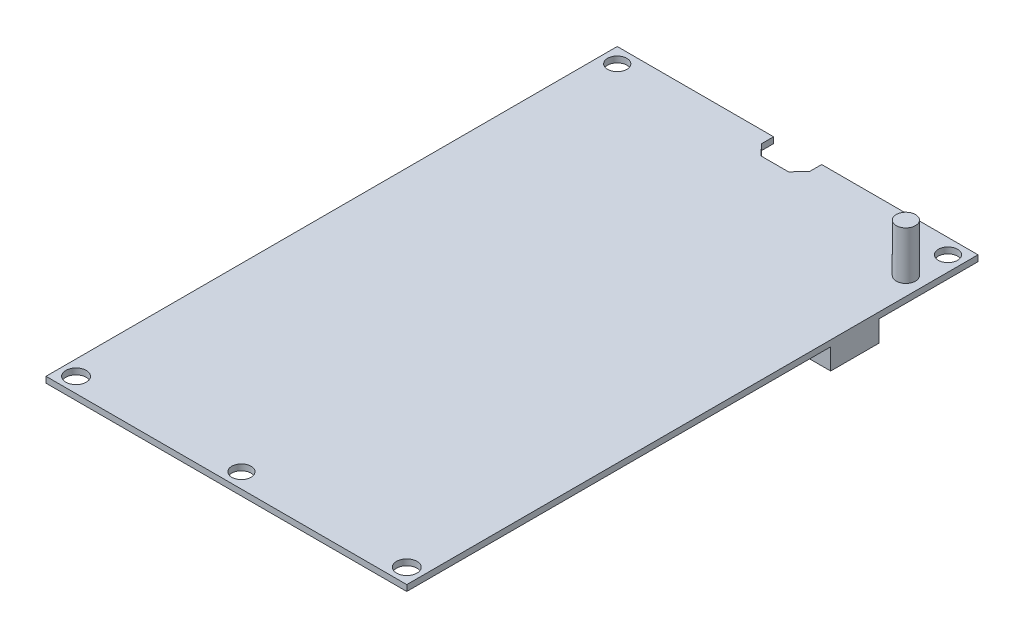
ISO-10303-21;
HEADER;
FILE_DESCRIPTION(('STEP AP214'),'2;1');
FILE_NAME('part.step','',(''),(''),'','','');
FILE_SCHEMA(('AUTOMOTIVE_DESIGN { 1 0 10303 214 1 1 1 1 }'));
ENDSEC;
DATA;
#1=APPLICATION_CONTEXT('core data for automotive mechanical design processes');
#2=APPLICATION_PROTOCOL_DEFINITION('international standard','automotive_design',2000,#1);
#3=PRODUCT_CONTEXT('',#1,'mechanical');
#4=PRODUCT('Part','Part','',(#3));
#5=PRODUCT_RELATED_PRODUCT_CATEGORY('part','',(#4));
#6=PRODUCT_DEFINITION_FORMATION('','',#4);
#7=PRODUCT_DEFINITION_CONTEXT('part definition',#1,'design');
#8=PRODUCT_DEFINITION('design','',#6,#7);
#9=PRODUCT_DEFINITION_SHAPE('','',#8);
#10=(LENGTH_UNIT() NAMED_UNIT(*) SI_UNIT(.MILLI.,.METRE.));
#11=(NAMED_UNIT(*) PLANE_ANGLE_UNIT() SI_UNIT($,.RADIAN.));
#12=(NAMED_UNIT(*) SI_UNIT($,.STERADIAN.) SOLID_ANGLE_UNIT());
#13=UNCERTAINTY_MEASURE_WITH_UNIT(LENGTH_MEASURE(1.E-05),#10,'distance_accuracy_value','');
#14=(GEOMETRIC_REPRESENTATION_CONTEXT(3) GLOBAL_UNCERTAINTY_ASSIGNED_CONTEXT((#13)) GLOBAL_UNIT_ASSIGNED_CONTEXT((#10,
#11,#12)) REPRESENTATION_CONTEXT('',''));
#15=CARTESIAN_POINT('',(0.,0.,0.));
#16=DIRECTION('',(0.,0.,1.));
#17=DIRECTION('',(1.,0.,0.));
#18=AXIS2_PLACEMENT_3D('',#15,#16,#17);
#19=CARTESIAN_POINT('',(0.,0.,0.));
#20=DIRECTION('',(0.,-1.,0.));
#21=DIRECTION('',(0.,0.,-1.));
#22=AXIS2_PLACEMENT_3D('',#19,#20,#21);
#23=PLANE('',#22);
#24=CARTESIAN_POINT('',(-27.5,0.,45.));
#25=DIRECTION('',(0.,1.,0.));
#26=DIRECTION('',(0.,0.,1.));
#27=AXIS2_PLACEMENT_3D('',#24,#25,#26);
#28=CIRCLE('',#27,1.7);
#29=CARTESIAN_POINT('',(-27.5,0.,46.7));
#30=VERTEX_POINT('',#29);
#31=EDGE_CURVE('E217',#30,#30,#28,.T.);
#32=ORIENTED_EDGE('',*,*,#31,.T.);
#33=EDGE_LOOP('',(#32));
#34=FACE_BOUND('',#33,.T.);
#35=CARTESIAN_POINT('',(27.5,0.,45.));
#36=DIRECTION('',(0.,1.,0.));
#37=DIRECTION('',(0.,0.,1.));
#38=AXIS2_PLACEMENT_3D('',#35,#36,#37);
#39=CIRCLE('',#38,1.7);
#40=CARTESIAN_POINT('',(27.5,0.,46.7));
#41=VERTEX_POINT('',#40);
#42=EDGE_CURVE('E224',#41,#41,#39,.T.);
#43=ORIENTED_EDGE('',*,*,#42,.T.);
#44=EDGE_LOOP('',(#43));
#45=FACE_BOUND('',#44,.T.);
#46=CARTESIAN_POINT('',(-27.5,0.,-45.));
#47=DIRECTION('',(0.,1.,0.));
#48=DIRECTION('',(0.,0.,1.));
#49=AXIS2_PLACEMENT_3D('',#46,#47,#48);
#50=CIRCLE('',#49,1.6);
#51=CARTESIAN_POINT('',(-27.5,0.,-43.4));
#52=VERTEX_POINT('',#51);
#53=EDGE_CURVE('E271',#52,#52,#50,.T.);
#54=ORIENTED_EDGE('',*,*,#53,.T.);
#55=EDGE_LOOP('',(#54));
#56=FACE_BOUND('',#55,.T.);
#57=CARTESIAN_POINT('',(27.5,0.,-45.));
#58=DIRECTION('',(0.,1.,0.));
#59=DIRECTION('',(0.,0.,1.));
#60=AXIS2_PLACEMENT_3D('',#57,#58,#59);
#61=CIRCLE('',#60,1.6);
#62=CARTESIAN_POINT('',(27.5,0.,-43.4));
#63=VERTEX_POINT('',#62);
#64=EDGE_CURVE('E278',#63,#63,#61,.T.);
#65=ORIENTED_EDGE('',*,*,#64,.T.);
#66=EDGE_LOOP('',(#65));
#67=FACE_BOUND('',#66,.T.);
#68=CARTESIAN_POINT('',(0.,0.,45.));
#69=DIRECTION('',(0.,1.,0.));
#70=DIRECTION('',(0.,0.,1.));
#71=AXIS2_PLACEMENT_3D('',#68,#69,#70);
#72=CIRCLE('',#71,1.6);
#73=CARTESIAN_POINT('',(0.,0.,46.6));
#74=VERTEX_POINT('',#73);
#75=EDGE_CURVE('E284',#74,#74,#72,.T.);
#76=ORIENTED_EDGE('',*,*,#75,.T.);
#77=EDGE_LOOP('',(#76));
#78=FACE_BOUND('',#77,.T.);
#79=DIRECTION('',(-1.,0.,0.));
#80=VECTOR('',#79,1.);
#81=CARTESIAN_POINT('',(15.,0.,-44.));
#82=LINE('',#81,#80);
#83=CARTESIAN_POINT('',(15.,0.,-44.));
#84=VERTEX_POINT('',#83);
#85=CARTESIAN_POINT('',(5.49999999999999,0.,-44.));
#86=VERTEX_POINT('',#85);
#87=EDGE_CURVE('E329',#84,#86,#82,.T.);
#88=ORIENTED_EDGE('',*,*,#87,.F.);
#89=DIRECTION('',(0.,0.,1.));
#90=VECTOR('',#89,1.);
#91=CARTESIAN_POINT('',(15.,0.,-47.5));
#92=LINE('',#91,#90);
#93=CARTESIAN_POINT('',(15.,0.,-47.5));
#94=VERTEX_POINT('',#93);
#95=EDGE_CURVE('E180',#94,#84,#92,.T.);
#96=ORIENTED_EDGE('',*,*,#95,.F.);
#97=DIRECTION('',(-1.,0.,0.));
#98=VECTOR('',#97,1.);
#99=CARTESIAN_POINT('',(-30.,0.,-47.5));
#100=LINE('',#99,#98);
#101=CARTESIAN_POINT('',(30.,0.,-47.5));
#102=VERTEX_POINT('',#101);
#103=EDGE_CURVE('E306',#102,#94,#100,.T.);
#104=ORIENTED_EDGE('',*,*,#103,.F.);
#105=DIRECTION('',(0.,0.,-1.));
#106=VECTOR('',#105,1.);
#107=CARTESIAN_POINT('',(30.,0.,47.5));
#108=LINE('',#107,#106);
#109=CARTESIAN_POINT('',(30.,0.,-31.));
#110=VERTEX_POINT('',#109);
#111=EDGE_CURVE('E274',#110,#102,#108,.T.);
#112=ORIENTED_EDGE('',*,*,#111,.F.);
#113=DIRECTION('',(1.,0.,0.));
#114=VECTOR('',#113,1.);
#115=CARTESIAN_POINT('',(30.,0.,-31.));
#116=LINE('',#115,#114);
#117=CARTESIAN_POINT('',(23.,0.,-31.));
#118=VERTEX_POINT('',#117);
#119=EDGE_CURVE('E56',#118,#110,#116,.T.);
#120=ORIENTED_EDGE('',*,*,#119,.F.);
#121=DIRECTION('',(0.,0.,-1.));
#122=VECTOR('',#121,1.);
#123=CARTESIAN_POINT('',(23.,0.,-23.));
#124=LINE('',#123,#122);
#125=CARTESIAN_POINT('',(23.,0.,-23.));
#126=VERTEX_POINT('',#125);
#127=EDGE_CURVE('E202',#126,#118,#124,.T.);
#128=ORIENTED_EDGE('',*,*,#127,.F.);
#129=DIRECTION('',(-1.,0.,0.));
#130=VECTOR('',#129,1.);
#131=CARTESIAN_POINT('',(30.,0.,-23.));
#132=LINE('',#131,#130);
#133=CARTESIAN_POINT('',(30.,0.,-23.));
#134=VERTEX_POINT('',#133);
#135=EDGE_CURVE('E185',#134,#126,#132,.T.);
#136=ORIENTED_EDGE('',*,*,#135,.F.);
#137=CARTESIAN_POINT('',(30.,0.,47.5));
#138=VERTEX_POINT('',#137);
#139=EDGE_CURVE('E302',#138,#134,#108,.T.);
#140=ORIENTED_EDGE('',*,*,#139,.F.);
#141=DIRECTION('',(1.,0.,0.));
#142=VECTOR('',#141,1.);
#143=CARTESIAN_POINT('',(-30.,0.,47.5));
#144=LINE('',#143,#142);
#145=CARTESIAN_POINT('',(-30.,0.,47.5));
#146=VERTEX_POINT('',#145);
#147=EDGE_CURVE('E293',#146,#138,#144,.T.);
#148=ORIENTED_EDGE('',*,*,#147,.F.);
#149=DIRECTION('',(0.,0.,1.));
#150=VECTOR('',#149,1.);
#151=CARTESIAN_POINT('',(-30.,0.,47.5));
#152=LINE('',#151,#150);
#153=CARTESIAN_POINT('',(-30.,0.,-47.5));
#154=VERTEX_POINT('',#153);
#155=EDGE_CURVE('E309',#154,#146,#152,.T.);
#156=ORIENTED_EDGE('',*,*,#155,.F.);
#157=CARTESIAN_POINT('',(-4.00000000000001,0.,-47.5));
#158=VERTEX_POINT('',#157);
#159=EDGE_CURVE('E305',#158,#154,#100,.T.);
#160=ORIENTED_EDGE('',*,*,#159,.F.);
#161=DIRECTION('',(0.,0.,1.));
#162=VECTOR('',#161,1.);
#163=CARTESIAN_POINT('',(-4.00000000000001,0.,-47.5));
#164=LINE('',#163,#162);
#165=CARTESIAN_POINT('',(-4.00000000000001,0.,-45.5));
#166=VERTEX_POINT('',#165);
#167=EDGE_CURVE('E229',#158,#166,#164,.T.);
#168=ORIENTED_EDGE('',*,*,#167,.T.);
#169=DIRECTION('',(0.684610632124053,0.,0.728908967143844));
#170=VECTOR('',#169,1.);
#171=CARTESIAN_POINT('',(-4.00000000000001,0.,-45.5));
#172=LINE('',#171,#170);
#173=CARTESIAN_POINT('',(-2.30000000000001,0.,-43.69));
#174=VERTEX_POINT('',#173);
#175=EDGE_CURVE('E232',#166,#174,#172,.T.);
#176=ORIENTED_EDGE('',*,*,#175,.T.);
#177=DIRECTION('',(1.,0.,0.));
#178=VECTOR('',#177,1.);
#179=CARTESIAN_POINT('',(-2.30000000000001,0.,-43.69));
#180=LINE('',#179,#178);
#181=CARTESIAN_POINT('',(2.29999999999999,0.,-43.69));
#182=VERTEX_POINT('',#181);
#183=EDGE_CURVE('E236',#174,#182,#180,.T.);
#184=ORIENTED_EDGE('',*,*,#183,.T.);
#185=DIRECTION('',(0.684610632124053,0.,-0.728908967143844));
#186=VECTOR('',#185,1.);
#187=CARTESIAN_POINT('',(2.29999999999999,0.,-43.69));
#188=LINE('',#187,#186);
#189=CARTESIAN_POINT('',(3.99999999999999,0.,-45.5));
#190=VERTEX_POINT('',#189);
#191=EDGE_CURVE('E239',#182,#190,#188,.T.);
#192=ORIENTED_EDGE('',*,*,#191,.T.);
#193=DIRECTION('',(0.,0.,-1.));
#194=VECTOR('',#193,1.);
#195=CARTESIAN_POINT('',(3.99999999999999,0.,-45.5));
#196=LINE('',#195,#194);
#197=CARTESIAN_POINT('',(3.99999999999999,0.,-47.5));
#198=VERTEX_POINT('',#197);
#199=EDGE_CURVE('E242',#190,#198,#196,.T.);
#200=ORIENTED_EDGE('',*,*,#199,.T.);
#201=CARTESIAN_POINT('',(5.49999999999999,0.,-47.5));
#202=VERTEX_POINT('',#201);
#203=EDGE_CURVE('E310',#202,#198,#100,.T.);
#204=ORIENTED_EDGE('',*,*,#203,.F.);
#205=DIRECTION('',(0.,0.,-1.));
#206=VECTOR('',#205,1.);
#207=CARTESIAN_POINT('',(5.49999999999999,0.,-47.5));
#208=LINE('',#207,#206);
#209=EDGE_CURVE('E176',#86,#202,#208,.T.);
#210=ORIENTED_EDGE('',*,*,#209,.F.);
#211=EDGE_LOOP('',(#88,#96,#104,#112,#120,#128,#136,#140,#148,#156,#160,#168,#176,#184,#192,
#200,#204,#210));
#212=FACE_BOUND('',#211,.T.);
#213=ADVANCED_FACE('F33',(#34,#45,#56,#67,#78,#212),#23,.T.);
#214=CARTESIAN_POINT('',(-30.,1.,-47.5));
#215=DIRECTION('',(0.,0.,1.));
#216=DIRECTION('',(1.,0.,0.));
#217=AXIS2_PLACEMENT_3D('',#214,#215,#216);
#218=PLANE('',#217);
#219=ORIENTED_EDGE('',*,*,#103,.T.);
#220=DIRECTION('',(0.,1.,0.));
#221=VECTOR('',#220,1.);
#222=CARTESIAN_POINT('',(15.,-2.5,-47.5));
#223=LINE('',#222,#221);
#224=CARTESIAN_POINT('',(15.,-2.5,-47.5));
#225=VERTEX_POINT('',#224);
#226=EDGE_CURVE('E336',#225,#94,#223,.T.);
#227=ORIENTED_EDGE('',*,*,#226,.F.);
#228=DIRECTION('',(1.,0.,0.));
#229=VECTOR('',#228,1.);
#230=CARTESIAN_POINT('',(15.,-2.5,-47.5));
#231=LINE('',#230,#229);
#232=CARTESIAN_POINT('',(5.49999999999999,-2.5,-47.5));
#233=VERTEX_POINT('',#232);
#234=EDGE_CURVE('E173',#233,#225,#231,.T.);
#235=ORIENTED_EDGE('',*,*,#234,.F.);
#236=DIRECTION('',(0.,1.,0.));
#237=VECTOR('',#236,1.);
#238=CARTESIAN_POINT('',(5.49999999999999,-2.5,-47.5));
#239=LINE('',#238,#237);
#240=EDGE_CURVE('E48',#233,#202,#239,.T.);
#241=ORIENTED_EDGE('',*,*,#240,.T.);
#242=ORIENTED_EDGE('',*,*,#203,.T.);
#243=DIRECTION('',(0.,1.,0.));
#244=VECTOR('',#243,1.);
#245=CARTESIAN_POINT('',(3.99999999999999,0.,-47.5));
#246=LINE('',#245,#244);
#247=CARTESIAN_POINT('',(3.99999999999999,1.,-47.5));
#248=VERTEX_POINT('',#247);
#249=EDGE_CURVE('E258',#198,#248,#246,.T.);
#250=ORIENTED_EDGE('',*,*,#249,.T.);
#251=DIRECTION('',(-1.,0.,0.));
#252=VECTOR('',#251,1.);
#253=CARTESIAN_POINT('',(-30.,1.,-47.5));
#254=LINE('',#253,#252);
#255=CARTESIAN_POINT('',(30.,1.,-47.5));
#256=VERTEX_POINT('',#255);
#257=EDGE_CURVE('E294',#256,#248,#254,.T.);
#258=ORIENTED_EDGE('',*,*,#257,.F.);
#259=DIRECTION('',(0.,-1.,0.));
#260=VECTOR('',#259,1.);
#261=CARTESIAN_POINT('',(30.,1.,-47.5));
#262=LINE('',#261,#260);
#263=EDGE_CURVE('E41',#256,#102,#262,.T.);
#264=ORIENTED_EDGE('',*,*,#263,.T.);
#265=EDGE_LOOP('',(#219,#227,#235,#241,#242,#250,#258,#264));
#266=FACE_BOUND('',#265,.T.);
#267=ADVANCED_FACE('F322',(#266),#218,.F.);
#268=CARTESIAN_POINT('',(30.,1.,47.5));
#269=DIRECTION('',(-1.,0.,0.));
#270=DIRECTION('',(0.,0.,1.));
#271=AXIS2_PLACEMENT_3D('',#268,#269,#270);
#272=PLANE('',#271);
#273=ORIENTED_EDGE('',*,*,#139,.T.);
#274=DIRECTION('',(0.,1.,0.));
#275=VECTOR('',#274,1.);
#276=CARTESIAN_POINT('',(30.,-3.5,-23.));
#277=LINE('',#276,#275);
#278=CARTESIAN_POINT('',(30.,-3.5,-23.));
#279=VERTEX_POINT('',#278);
#280=EDGE_CURVE('E213',#279,#134,#277,.T.);
#281=ORIENTED_EDGE('',*,*,#280,.F.);
#282=DIRECTION('',(0.,0.,1.));
#283=VECTOR('',#282,1.);
#284=CARTESIAN_POINT('',(30.,-3.5,-23.));
#285=LINE('',#284,#283);
#286=CARTESIAN_POINT('',(30.,-3.5,-31.));
#287=VERTEX_POINT('',#286);
#288=EDGE_CURVE('E190',#287,#279,#285,.T.);
#289=ORIENTED_EDGE('',*,*,#288,.F.);
#290=DIRECTION('',(0.,1.,0.));
#291=VECTOR('',#290,1.);
#292=CARTESIAN_POINT('',(30.,-3.5,-31.));
#293=LINE('',#292,#291);
#294=EDGE_CURVE('E199',#287,#110,#293,.T.);
#295=ORIENTED_EDGE('',*,*,#294,.T.);
#296=ORIENTED_EDGE('',*,*,#111,.T.);
#297=ORIENTED_EDGE('',*,*,#263,.F.);
#298=DIRECTION('',(0.,0.,-1.));
#299=VECTOR('',#298,1.);
#300=CARTESIAN_POINT('',(30.,1.,47.5));
#301=LINE('',#300,#299);
#302=CARTESIAN_POINT('',(30.,1.,47.5));
#303=VERTEX_POINT('',#302);
#304=EDGE_CURVE('E289',#303,#256,#301,.T.);
#305=ORIENTED_EDGE('',*,*,#304,.F.);
#306=DIRECTION('',(0.,-1.,0.));
#307=VECTOR('',#306,1.);
#308=CARTESIAN_POINT('',(30.,1.,47.5));
#309=LINE('',#308,#307);
#310=EDGE_CURVE('E301',#303,#138,#309,.T.);
#311=ORIENTED_EDGE('',*,*,#310,.T.);
#312=EDGE_LOOP('',(#273,#281,#289,#295,#296,#297,#305,#311));
#313=FACE_BOUND('',#312,.T.);
#314=ADVANCED_FACE('F35',(#313),#272,.F.);
#315=CARTESIAN_POINT('',(-4.00000000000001,1.,-47.5));
#316=VERTEX_POINT('',#315);
#317=CARTESIAN_POINT('',(-30.,1.,-47.5));
#318=VERTEX_POINT('',#317);
#319=EDGE_CURVE('E292',#316,#318,#254,.T.);
#320=ORIENTED_EDGE('',*,*,#319,.F.);
#321=DIRECTION('',(0.,1.,0.));
#322=VECTOR('',#321,1.);
#323=CARTESIAN_POINT('',(-4.00000000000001,0.,-47.5));
#324=LINE('',#323,#322);
#325=EDGE_CURVE('E245',#158,#316,#324,.T.);
#326=ORIENTED_EDGE('',*,*,#325,.F.);
#327=ORIENTED_EDGE('',*,*,#159,.T.);
#328=DIRECTION('',(0.,-1.,0.));
#329=VECTOR('',#328,1.);
#330=CARTESIAN_POINT('',(-30.,1.,-47.5));
#331=LINE('',#330,#329);
#332=EDGE_CURVE('E318',#318,#154,#331,.T.);
#333=ORIENTED_EDGE('',*,*,#332,.F.);
#334=EDGE_LOOP('',(#320,#326,#327,#333));
#335=FACE_BOUND('',#334,.T.);
#336=ADVANCED_FACE('F347',(#335),#218,.F.);
#337=CARTESIAN_POINT('',(-30.,1.,47.5));
#338=DIRECTION('',(1.,0.,0.));
#339=DIRECTION('',(0.,0.,-1.));
#340=AXIS2_PLACEMENT_3D('',#337,#338,#339);
#341=PLANE('',#340);
#342=ORIENTED_EDGE('',*,*,#155,.T.);
#343=DIRECTION('',(0.,-1.,0.));
#344=VECTOR('',#343,1.);
#345=CARTESIAN_POINT('',(-30.,1.,47.5));
#346=LINE('',#345,#344);
#347=CARTESIAN_POINT('',(-30.,1.,47.5));
#348=VERTEX_POINT('',#347);
#349=EDGE_CURVE('E315',#348,#146,#346,.T.);
#350=ORIENTED_EDGE('',*,*,#349,.F.);
#351=DIRECTION('',(0.,0.,1.));
#352=VECTOR('',#351,1.);
#353=CARTESIAN_POINT('',(-30.,1.,47.5));
#354=LINE('',#353,#352);
#355=EDGE_CURVE('E297',#318,#348,#354,.T.);
#356=ORIENTED_EDGE('',*,*,#355,.F.);
#357=ORIENTED_EDGE('',*,*,#332,.T.);
#358=EDGE_LOOP('',(#342,#350,#356,#357));
#359=FACE_BOUND('',#358,.T.);
#360=ADVANCED_FACE('F351',(#359),#341,.F.);
#361=CARTESIAN_POINT('',(-30.,1.,47.5));
#362=DIRECTION('',(0.,0.,-1.));
#363=DIRECTION('',(-1.,0.,0.));
#364=AXIS2_PLACEMENT_3D('',#361,#362,#363);
#365=PLANE('',#364);
#366=ORIENTED_EDGE('',*,*,#147,.T.);
#367=ORIENTED_EDGE('',*,*,#310,.F.);
#368=DIRECTION('',(1.,0.,0.));
#369=VECTOR('',#368,1.);
#370=CARTESIAN_POINT('',(-30.,1.,47.5));
#371=LINE('',#370,#369);
#372=EDGE_CURVE('E299',#348,#303,#371,.T.);
#373=ORIENTED_EDGE('',*,*,#372,.F.);
#374=ORIENTED_EDGE('',*,*,#349,.T.);
#375=EDGE_LOOP('',(#366,#367,#373,#374));
#376=FACE_BOUND('',#375,.T.);
#377=ADVANCED_FACE('F357',(#376),#365,.F.);
#378=CARTESIAN_POINT('',(0.,1.,0.));
#379=DIRECTION('',(0.,-1.,0.));
#380=DIRECTION('',(0.,0.,-1.));
#381=AXIS2_PLACEMENT_3D('',#378,#379,#380);
#382=PLANE('',#381);
#383=CARTESIAN_POINT('',(27.,1.,-38.5));
#384=DIRECTION('',(0.,-1.,0.));
#385=DIRECTION('',(0.,0.,-1.));
#386=AXIS2_PLACEMENT_3D('',#383,#384,#385);
#387=CIRCLE('',#386,1.6);
#388=CARTESIAN_POINT('',(27.,1.,-40.1));
#389=VERTEX_POINT('',#388);
#390=EDGE_CURVE('E11',#389,#389,#387,.F.);
#391=ORIENTED_EDGE('',*,*,#390,.F.);
#392=EDGE_LOOP('',(#391));
#393=FACE_BOUND('',#392,.T.);
#394=CARTESIAN_POINT('',(-27.5,1.,45.));
#395=DIRECTION('',(0.,1.,0.));
#396=DIRECTION('',(0.,0.,1.));
#397=AXIS2_PLACEMENT_3D('',#394,#395,#396);
#398=CIRCLE('',#397,1.7);
#399=CARTESIAN_POINT('',(-27.5,1.,46.7));
#400=VERTEX_POINT('',#399);
#401=EDGE_CURVE('E221',#400,#400,#398,.T.);
#402=ORIENTED_EDGE('',*,*,#401,.F.);
#403=EDGE_LOOP('',(#402));
#404=FACE_BOUND('',#403,.T.);
#405=CARTESIAN_POINT('',(27.5,1.,45.));
#406=DIRECTION('',(0.,1.,0.));
#407=DIRECTION('',(0.,0.,1.));
#408=AXIS2_PLACEMENT_3D('',#405,#406,#407);
#409=CIRCLE('',#408,1.7);
#410=CARTESIAN_POINT('',(27.5,1.,46.7));
#411=VERTEX_POINT('',#410);
#412=EDGE_CURVE('E216',#411,#411,#409,.T.);
#413=ORIENTED_EDGE('',*,*,#412,.F.);
#414=EDGE_LOOP('',(#413));
#415=FACE_BOUND('',#414,.T.);
#416=CARTESIAN_POINT('',(-27.5,1.,-45.));
#417=DIRECTION('',(0.,1.,0.));
#418=DIRECTION('',(0.,0.,1.));
#419=AXIS2_PLACEMENT_3D('',#416,#417,#418);
#420=CIRCLE('',#419,1.6);
#421=CARTESIAN_POINT('',(-27.5,1.,-43.4));
#422=VERTEX_POINT('',#421);
#423=EDGE_CURVE('E275',#422,#422,#420,.T.);
#424=ORIENTED_EDGE('',*,*,#423,.F.);
#425=EDGE_LOOP('',(#424));
#426=FACE_BOUND('',#425,.T.);
#427=CARTESIAN_POINT('',(27.5,1.,-45.));
#428=DIRECTION('',(0.,1.,0.));
#429=DIRECTION('',(0.,0.,1.));
#430=AXIS2_PLACEMENT_3D('',#427,#428,#429);
#431=CIRCLE('',#430,1.6);
#432=CARTESIAN_POINT('',(27.5,1.,-43.4));
#433=VERTEX_POINT('',#432);
#434=EDGE_CURVE('E281',#433,#433,#431,.T.);
#435=ORIENTED_EDGE('',*,*,#434,.F.);
#436=EDGE_LOOP('',(#435));
#437=FACE_BOUND('',#436,.T.);
#438=CARTESIAN_POINT('',(0.,1.,45.));
#439=DIRECTION('',(0.,1.,0.));
#440=DIRECTION('',(0.,0.,1.));
#441=AXIS2_PLACEMENT_3D('',#438,#439,#440);
#442=CIRCLE('',#441,1.6);
#443=CARTESIAN_POINT('',(0.,1.,46.6));
#444=VERTEX_POINT('',#443);
#445=EDGE_CURVE('E261',#444,#444,#442,.T.);
#446=ORIENTED_EDGE('',*,*,#445,.F.);
#447=EDGE_LOOP('',(#446));
#448=FACE_BOUND('',#447,.T.);
#449=ORIENTED_EDGE('',*,*,#257,.T.);
#450=DIRECTION('',(0.,0.,-1.));
#451=VECTOR('',#450,1.);
#452=CARTESIAN_POINT('',(3.99999999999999,1.,-45.5));
#453=LINE('',#452,#451);
#454=CARTESIAN_POINT('',(3.99999999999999,1.,-45.5));
#455=VERTEX_POINT('',#454);
#456=EDGE_CURVE('E233',#455,#248,#453,.T.);
#457=ORIENTED_EDGE('',*,*,#456,.F.);
#458=DIRECTION('',(0.684610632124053,0.,-0.728908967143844));
#459=VECTOR('',#458,1.);
#460=CARTESIAN_POINT('',(2.29999999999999,1.,-43.69));
#461=LINE('',#460,#459);
#462=CARTESIAN_POINT('',(2.29999999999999,1.,-43.69));
#463=VERTEX_POINT('',#462);
#464=EDGE_CURVE('E254',#463,#455,#461,.T.);
#465=ORIENTED_EDGE('',*,*,#464,.F.);
#466=DIRECTION('',(1.,0.,0.));
#467=VECTOR('',#466,1.);
#468=CARTESIAN_POINT('',(-2.30000000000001,1.,-43.69));
#469=LINE('',#468,#467);
#470=CARTESIAN_POINT('',(-2.30000000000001,1.,-43.69));
#471=VERTEX_POINT('',#470);
#472=EDGE_CURVE('E251',#471,#463,#469,.T.);
#473=ORIENTED_EDGE('',*,*,#472,.F.);
#474=DIRECTION('',(0.684610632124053,0.,0.728908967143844));
#475=VECTOR('',#474,1.);
#476=CARTESIAN_POINT('',(-4.00000000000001,1.,-45.5));
#477=LINE('',#476,#475);
#478=CARTESIAN_POINT('',(-4.00000000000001,1.,-45.5));
#479=VERTEX_POINT('',#478);
#480=EDGE_CURVE('E248',#479,#471,#477,.T.);
#481=ORIENTED_EDGE('',*,*,#480,.F.);
#482=DIRECTION('',(0.,0.,1.));
#483=VECTOR('',#482,1.);
#484=CARTESIAN_POINT('',(-4.00000000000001,1.,-47.5));
#485=LINE('',#484,#483);
#486=EDGE_CURVE('E220',#316,#479,#485,.T.);
#487=ORIENTED_EDGE('',*,*,#486,.F.);
#488=ORIENTED_EDGE('',*,*,#319,.T.);
#489=ORIENTED_EDGE('',*,*,#355,.T.);
#490=ORIENTED_EDGE('',*,*,#372,.T.);
#491=ORIENTED_EDGE('',*,*,#304,.T.);
#492=EDGE_LOOP('',(#449,#457,#465,#473,#481,#487,#488,#489,#490,#491));
#493=FACE_BOUND('',#492,.T.);
#494=ADVANCED_FACE('F392',(#393,#404,#415,#426,#437,#448,#493),#382,.F.);
#495=CARTESIAN_POINT('',(0.,0.,45.));
#496=DIRECTION('',(0.,1.,0.));
#497=DIRECTION('',(0.,0.,1.));
#498=AXIS2_PLACEMENT_3D('',#495,#496,#497);
#499=CYLINDRICAL_SURFACE('',#498,1.6);
#500=ORIENTED_EDGE('',*,*,#75,.F.);
#501=EDGE_LOOP('',(#500));
#502=FACE_BOUND('',#501,.T.);
#503=ORIENTED_EDGE('',*,*,#445,.T.);
#504=EDGE_LOOP('',(#503));
#505=FACE_BOUND('',#504,.T.);
#506=ADVANCED_FACE('F412',(#502,#505),#499,.F.);
#507=CARTESIAN_POINT('',(27.5,0.,-45.));
#508=DIRECTION('',(0.,1.,0.));
#509=DIRECTION('',(0.,0.,1.));
#510=AXIS2_PLACEMENT_3D('',#507,#508,#509);
#511=CYLINDRICAL_SURFACE('',#510,1.6);
#512=ORIENTED_EDGE('',*,*,#64,.F.);
#513=EDGE_LOOP('',(#512));
#514=FACE_BOUND('',#513,.T.);
#515=ORIENTED_EDGE('',*,*,#434,.T.);
#516=EDGE_LOOP('',(#515));
#517=FACE_BOUND('',#516,.T.);
#518=ADVANCED_FACE('F416',(#514,#517),#511,.F.);
#519=CARTESIAN_POINT('',(-27.5,0.,-45.));
#520=DIRECTION('',(0.,1.,0.));
#521=DIRECTION('',(0.,0.,1.));
#522=AXIS2_PLACEMENT_3D('',#519,#520,#521);
#523=CYLINDRICAL_SURFACE('',#522,1.6);
#524=ORIENTED_EDGE('',*,*,#53,.F.);
#525=EDGE_LOOP('',(#524));
#526=FACE_BOUND('',#525,.T.);
#527=ORIENTED_EDGE('',*,*,#423,.T.);
#528=EDGE_LOOP('',(#527));
#529=FACE_BOUND('',#528,.T.);
#530=ADVANCED_FACE('F424',(#526,#529),#523,.F.);
#531=CARTESIAN_POINT('',(3.99999999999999,0.,-45.5));
#532=DIRECTION('',(1.,0.,0.));
#533=DIRECTION('',(0.,0.,-1.));
#534=AXIS2_PLACEMENT_3D('',#531,#532,#533);
#535=PLANE('',#534);
#536=ORIENTED_EDGE('',*,*,#456,.T.);
#537=ORIENTED_EDGE('',*,*,#249,.F.);
#538=ORIENTED_EDGE('',*,*,#199,.F.);
#539=DIRECTION('',(0.,1.,0.));
#540=VECTOR('',#539,1.);
#541=CARTESIAN_POINT('',(3.99999999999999,0.,-45.5));
#542=LINE('',#541,#540);
#543=EDGE_CURVE('E262',#190,#455,#542,.T.);
#544=ORIENTED_EDGE('',*,*,#543,.T.);
#545=EDGE_LOOP('',(#536,#537,#538,#544));
#546=FACE_BOUND('',#545,.T.);
#547=ADVANCED_FACE('F431',(#546),#535,.F.);
#548=CARTESIAN_POINT('',(2.29999999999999,0.,-43.69));
#549=DIRECTION('',(0.728908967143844,0.,0.684610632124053));
#550=DIRECTION('',(0.684610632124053,0.,-0.728908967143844));
#551=AXIS2_PLACEMENT_3D('',#548,#549,#550);
#552=PLANE('',#551);
#553=ORIENTED_EDGE('',*,*,#464,.T.);
#554=ORIENTED_EDGE('',*,*,#543,.F.);
#555=ORIENTED_EDGE('',*,*,#191,.F.);
#556=DIRECTION('',(0.,1.,0.));
#557=VECTOR('',#556,1.);
#558=CARTESIAN_POINT('',(2.29999999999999,0.,-43.69));
#559=LINE('',#558,#557);
#560=EDGE_CURVE('E264',#182,#463,#559,.T.);
#561=ORIENTED_EDGE('',*,*,#560,.T.);
#562=EDGE_LOOP('',(#553,#554,#555,#561));
#563=FACE_BOUND('',#562,.T.);
#564=ADVANCED_FACE('F438',(#563),#552,.F.);
#565=CARTESIAN_POINT('',(-2.30000000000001,0.,-43.69));
#566=DIRECTION('',(0.,0.,1.));
#567=DIRECTION('',(1.,0.,0.));
#568=AXIS2_PLACEMENT_3D('',#565,#566,#567);
#569=PLANE('',#568);
#570=ORIENTED_EDGE('',*,*,#472,.T.);
#571=ORIENTED_EDGE('',*,*,#560,.F.);
#572=ORIENTED_EDGE('',*,*,#183,.F.);
#573=DIRECTION('',(0.,1.,0.));
#574=VECTOR('',#573,1.);
#575=CARTESIAN_POINT('',(-2.30000000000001,0.,-43.69));
#576=LINE('',#575,#574);
#577=EDGE_CURVE('E266',#174,#471,#576,.T.);
#578=ORIENTED_EDGE('',*,*,#577,.T.);
#579=EDGE_LOOP('',(#570,#571,#572,#578));
#580=FACE_BOUND('',#579,.T.);
#581=ADVANCED_FACE('F446',(#580),#569,.F.);
#582=CARTESIAN_POINT('',(-4.00000000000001,0.,-45.5));
#583=DIRECTION('',(-0.728908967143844,0.,0.684610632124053));
#584=DIRECTION('',(0.684610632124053,0.,0.728908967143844));
#585=AXIS2_PLACEMENT_3D('',#582,#583,#584);
#586=PLANE('',#585);
#587=ORIENTED_EDGE('',*,*,#480,.T.);
#588=ORIENTED_EDGE('',*,*,#577,.F.);
#589=ORIENTED_EDGE('',*,*,#175,.F.);
#590=DIRECTION('',(0.,1.,0.));
#591=VECTOR('',#590,1.);
#592=CARTESIAN_POINT('',(-4.00000000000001,0.,-45.5));
#593=LINE('',#592,#591);
#594=EDGE_CURVE('E268',#166,#479,#593,.T.);
#595=ORIENTED_EDGE('',*,*,#594,.T.);
#596=EDGE_LOOP('',(#587,#588,#589,#595));
#597=FACE_BOUND('',#596,.T.);
#598=ADVANCED_FACE('F454',(#597),#586,.F.);
#599=CARTESIAN_POINT('',(-4.00000000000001,0.,-47.5));
#600=DIRECTION('',(-1.,0.,0.));
#601=DIRECTION('',(0.,0.,1.));
#602=AXIS2_PLACEMENT_3D('',#599,#600,#601);
#603=PLANE('',#602);
#604=ORIENTED_EDGE('',*,*,#486,.T.);
#605=ORIENTED_EDGE('',*,*,#594,.F.);
#606=ORIENTED_EDGE('',*,*,#167,.F.);
#607=ORIENTED_EDGE('',*,*,#325,.T.);
#608=EDGE_LOOP('',(#604,#605,#606,#607));
#609=FACE_BOUND('',#608,.T.);
#610=ADVANCED_FACE('F462',(#609),#603,.F.);
#611=CARTESIAN_POINT('',(27.5,0.,45.));
#612=DIRECTION('',(0.,1.,0.));
#613=DIRECTION('',(0.,0.,1.));
#614=AXIS2_PLACEMENT_3D('',#611,#612,#613);
#615=CYLINDRICAL_SURFACE('',#614,1.7);
#616=ORIENTED_EDGE('',*,*,#42,.F.);
#617=EDGE_LOOP('',(#616));
#618=FACE_BOUND('',#617,.T.);
#619=ORIENTED_EDGE('',*,*,#412,.T.);
#620=EDGE_LOOP('',(#619));
#621=FACE_BOUND('',#620,.T.);
#622=ADVANCED_FACE('F470',(#618,#621),#615,.F.);
#623=CARTESIAN_POINT('',(-27.5,0.,45.));
#624=DIRECTION('',(0.,1.,0.));
#625=DIRECTION('',(0.,0.,1.));
#626=AXIS2_PLACEMENT_3D('',#623,#624,#625);
#627=CYLINDRICAL_SURFACE('',#626,1.7);
#628=ORIENTED_EDGE('',*,*,#31,.F.);
#629=EDGE_LOOP('',(#628));
#630=FACE_BOUND('',#629,.T.);
#631=ORIENTED_EDGE('',*,*,#401,.T.);
#632=EDGE_LOOP('',(#631));
#633=FACE_BOUND('',#632,.T.);
#634=ADVANCED_FACE('F379',(#630,#633),#627,.F.);
#635=CARTESIAN_POINT('',(30.,-3.5,-23.));
#636=DIRECTION('',(0.,0.,-1.));
#637=DIRECTION('',(-1.,0.,0.));
#638=AXIS2_PLACEMENT_3D('',#635,#636,#637);
#639=PLANE('',#638);
#640=ORIENTED_EDGE('',*,*,#135,.T.);
#641=DIRECTION('',(0.,1.,0.));
#642=VECTOR('',#641,1.);
#643=CARTESIAN_POINT('',(23.,-3.5,-23.));
#644=LINE('',#643,#642);
#645=CARTESIAN_POINT('',(23.,-3.5,-23.));
#646=VERTEX_POINT('',#645);
#647=EDGE_CURVE('E210',#646,#126,#644,.T.);
#648=ORIENTED_EDGE('',*,*,#647,.F.);
#649=DIRECTION('',(-1.,0.,0.));
#650=VECTOR('',#649,1.);
#651=CARTESIAN_POINT('',(30.,-3.5,-23.));
#652=LINE('',#651,#650);
#653=EDGE_CURVE('E193',#279,#646,#652,.T.);
#654=ORIENTED_EDGE('',*,*,#653,.F.);
#655=ORIENTED_EDGE('',*,*,#280,.T.);
#656=EDGE_LOOP('',(#640,#648,#654,#655));
#657=FACE_BOUND('',#656,.T.);
#658=ADVANCED_FACE('F361',(#657),#639,.F.);
#659=CARTESIAN_POINT('',(23.,-3.5,-23.));
#660=DIRECTION('',(1.,0.,0.));
#661=DIRECTION('',(0.,0.,-1.));
#662=AXIS2_PLACEMENT_3D('',#659,#660,#661);
#663=PLANE('',#662);
#664=ORIENTED_EDGE('',*,*,#127,.T.);
#665=DIRECTION('',(0.,1.,0.));
#666=VECTOR('',#665,1.);
#667=CARTESIAN_POINT('',(23.,-3.5,-31.));
#668=LINE('',#667,#666);
#669=CARTESIAN_POINT('',(23.,-3.5,-31.));
#670=VERTEX_POINT('',#669);
#671=EDGE_CURVE('E207',#670,#118,#668,.T.);
#672=ORIENTED_EDGE('',*,*,#671,.F.);
#673=DIRECTION('',(0.,0.,-1.));
#674=VECTOR('',#673,1.);
#675=CARTESIAN_POINT('',(23.,-3.5,-23.));
#676=LINE('',#675,#674);
#677=EDGE_CURVE('E195',#646,#670,#676,.T.);
#678=ORIENTED_EDGE('',*,*,#677,.F.);
#679=ORIENTED_EDGE('',*,*,#647,.T.);
#680=EDGE_LOOP('',(#664,#672,#678,#679));
#681=FACE_BOUND('',#680,.T.);
#682=ADVANCED_FACE('F371',(#681),#663,.F.);
#683=CARTESIAN_POINT('',(30.,-3.5,-31.));
#684=DIRECTION('',(0.,0.,1.));
#685=DIRECTION('',(1.,0.,0.));
#686=AXIS2_PLACEMENT_3D('',#683,#684,#685);
#687=PLANE('',#686);
#688=ORIENTED_EDGE('',*,*,#119,.T.);
#689=ORIENTED_EDGE('',*,*,#294,.F.);
#690=DIRECTION('',(1.,0.,0.));
#691=VECTOR('',#690,1.);
#692=CARTESIAN_POINT('',(30.,-3.5,-31.));
#693=LINE('',#692,#691);
#694=EDGE_CURVE('E197',#670,#287,#693,.T.);
#695=ORIENTED_EDGE('',*,*,#694,.F.);
#696=ORIENTED_EDGE('',*,*,#671,.T.);
#697=EDGE_LOOP('',(#688,#689,#695,#696));
#698=FACE_BOUND('',#697,.T.);
#699=ADVANCED_FACE('F369',(#698),#687,.F.);
#700=CARTESIAN_POINT('',(0.,-3.5,0.));
#701=DIRECTION('',(0.,1.,0.));
#702=DIRECTION('',(0.,0.,1.));
#703=AXIS2_PLACEMENT_3D('',#700,#701,#702);
#704=PLANE('',#703);
#705=ORIENTED_EDGE('',*,*,#288,.T.);
#706=ORIENTED_EDGE('',*,*,#653,.T.);
#707=ORIENTED_EDGE('',*,*,#677,.T.);
#708=ORIENTED_EDGE('',*,*,#694,.T.);
#709=EDGE_LOOP('',(#705,#706,#707,#708));
#710=FACE_BOUND('',#709,.T.);
#711=ADVANCED_FACE('F365',(#710),#704,.F.);
#712=CARTESIAN_POINT('',(27.,9.,-38.5));
#713=DIRECTION('',(0.,-1.,0.));
#714=DIRECTION('',(0.,0.,-1.));
#715=AXIS2_PLACEMENT_3D('',#712,#713,#714);
#716=CYLINDRICAL_SURFACE('',#715,1.6);
#717=CARTESIAN_POINT('',(27.,9.,-38.5));
#718=DIRECTION('',(0.,1.,0.));
#719=DIRECTION('',(0.,0.,1.));
#720=AXIS2_PLACEMENT_3D('',#717,#718,#719);
#721=CIRCLE('',#720,1.6);
#722=CARTESIAN_POINT('',(27.,9.,-36.9));
#723=VERTEX_POINT('',#722);
#724=EDGE_CURVE('E182',#723,#723,#721,.T.);
#725=ORIENTED_EDGE('',*,*,#724,.F.);
#726=EDGE_LOOP('',(#725));
#727=FACE_BOUND('',#726,.T.);
#728=ORIENTED_EDGE('',*,*,#390,.T.);
#729=EDGE_LOOP('',(#728));
#730=FACE_BOUND('',#729,.T.);
#731=ADVANCED_FACE('F507',(#727,#730),#716,.T.);
#732=CARTESIAN_POINT('',(27.,9.,-38.5));
#733=DIRECTION('',(0.,1.,0.));
#734=DIRECTION('',(0.,0.,1.));
#735=AXIS2_PLACEMENT_3D('',#732,#733,#734);
#736=PLANE('',#735);
#737=ORIENTED_EDGE('',*,*,#724,.T.);
#738=EDGE_LOOP('',(#737));
#739=FACE_BOUND('',#738,.T.);
#740=ADVANCED_FACE('F521',(#739),#736,.T.);
#741=CARTESIAN_POINT('',(15.,-2.5,-47.5));
#742=DIRECTION('',(-1.,0.,0.));
#743=DIRECTION('',(0.,0.,1.));
#744=AXIS2_PLACEMENT_3D('',#741,#742,#743);
#745=PLANE('',#744);
#746=ORIENTED_EDGE('',*,*,#95,.T.);
#747=DIRECTION('',(0.,1.,0.));
#748=VECTOR('',#747,1.);
#749=CARTESIAN_POINT('',(15.,-2.5,-44.));
#750=LINE('',#749,#748);
#751=CARTESIAN_POINT('',(15.,-2.5,-44.));
#752=VERTEX_POINT('',#751);
#753=EDGE_CURVE('E162',#752,#84,#750,.T.);
#754=ORIENTED_EDGE('',*,*,#753,.F.);
#755=DIRECTION('',(0.,0.,1.));
#756=VECTOR('',#755,1.);
#757=CARTESIAN_POINT('',(15.,-2.5,-47.5));
#758=LINE('',#757,#756);
#759=EDGE_CURVE('E169',#225,#752,#758,.T.);
#760=ORIENTED_EDGE('',*,*,#759,.F.);
#761=ORIENTED_EDGE('',*,*,#226,.T.);
#762=EDGE_LOOP('',(#746,#754,#760,#761));
#763=FACE_BOUND('',#762,.T.);
#764=ADVANCED_FACE('F178',(#763),#745,.F.);
#765=CARTESIAN_POINT('',(15.,-2.5,-44.));
#766=DIRECTION('',(0.,0.,-1.));
#767=DIRECTION('',(-1.,0.,0.));
#768=AXIS2_PLACEMENT_3D('',#765,#766,#767);
#769=PLANE('',#768);
#770=ORIENTED_EDGE('',*,*,#87,.T.);
#771=DIRECTION('',(0.,1.,0.));
#772=VECTOR('',#771,1.);
#773=CARTESIAN_POINT('',(5.49999999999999,-2.5,-44.));
#774=LINE('',#773,#772);
#775=CARTESIAN_POINT('',(5.49999999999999,-2.5,-44.));
#776=VERTEX_POINT('',#775);
#777=EDGE_CURVE('E165',#776,#86,#774,.T.);
#778=ORIENTED_EDGE('',*,*,#777,.F.);
#779=DIRECTION('',(-1.,0.,0.));
#780=VECTOR('',#779,1.);
#781=CARTESIAN_POINT('',(15.,-2.5,-44.));
#782=LINE('',#781,#780);
#783=EDGE_CURVE('E158',#752,#776,#782,.T.);
#784=ORIENTED_EDGE('',*,*,#783,.F.);
#785=ORIENTED_EDGE('',*,*,#753,.T.);
#786=EDGE_LOOP('',(#770,#778,#784,#785));
#787=FACE_BOUND('',#786,.T.);
#788=ADVANCED_FACE('F160',(#787),#769,.F.);
#789=CARTESIAN_POINT('',(5.49999999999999,-2.5,-47.5));
#790=DIRECTION('',(1.,0.,0.));
#791=DIRECTION('',(0.,0.,-1.));
#792=AXIS2_PLACEMENT_3D('',#789,#790,#791);
#793=PLANE('',#792);
#794=ORIENTED_EDGE('',*,*,#209,.T.);
#795=ORIENTED_EDGE('',*,*,#240,.F.);
#796=DIRECTION('',(0.,0.,-1.));
#797=VECTOR('',#796,1.);
#798=CARTESIAN_POINT('',(5.49999999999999,-2.5,-47.5));
#799=LINE('',#798,#797);
#800=EDGE_CURVE('E168',#776,#233,#799,.T.);
#801=ORIENTED_EDGE('',*,*,#800,.F.);
#802=ORIENTED_EDGE('',*,*,#777,.T.);
#803=EDGE_LOOP('',(#794,#795,#801,#802));
#804=FACE_BOUND('',#803,.T.);
#805=ADVANCED_FACE('F338',(#804),#793,.F.);
#806=CARTESIAN_POINT('',(0.,-2.5,0.));
#807=DIRECTION('',(0.,-1.,0.));
#808=DIRECTION('',(0.,0.,-1.));
#809=AXIS2_PLACEMENT_3D('',#806,#807,#808);
#810=PLANE('',#809);
#811=ORIENTED_EDGE('',*,*,#759,.T.);
#812=ORIENTED_EDGE('',*,*,#783,.T.);
#813=ORIENTED_EDGE('',*,*,#800,.T.);
#814=ORIENTED_EDGE('',*,*,#234,.T.);
#815=EDGE_LOOP('',(#811,#812,#813,#814));
#816=FACE_BOUND('',#815,.T.);
#817=ADVANCED_FACE('F172',(#816),#810,.T.);
#818=CLOSED_SHELL('',(#213,#267,#314,#336,#360,#377,#494,#506,#518,#530,#547,#564,#581,#598,
#610,#622,#634,#658,#682,#699,#711,#731,#740,#764,#788,#805,#817));
#819=MANIFOLD_SOLID_BREP('B2',#818);
#820=ADVANCED_BREP_SHAPE_REPRESENTATION('',(#18,#819),#14);
#821=SHAPE_DEFINITION_REPRESENTATION(#9,#820);
ENDSEC;
END-ISO-10303-21;
